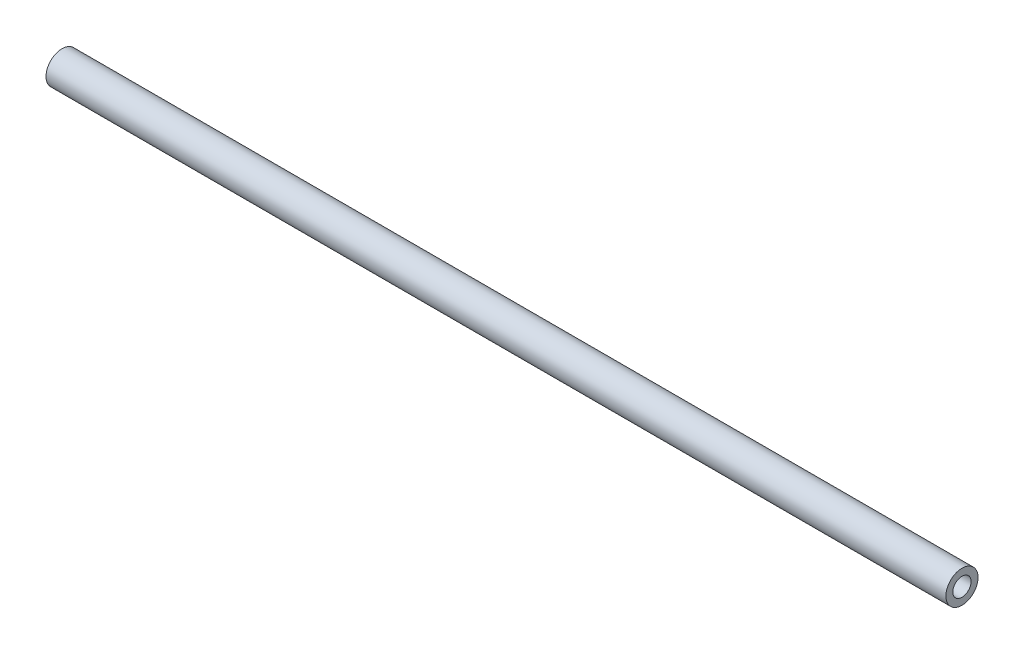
from build123d import *

# Parameters (mm, degrees)
SKETCH1_W                           = 133.35
SKETCH1_H                           = 2.38125
F_6_32_TAPPED_HOLE1_D               = 2.7051
F_6_32_TAPPED_HOLE1_DEPTH           = 12.7
F_6_32_TAPPED_HOLE1_TIP             = 0.81269403
F_6_32_TAPPED_HOLE1_ON_FACE_2_D     = 2.7051
F_6_32_TAPPED_HOLE1_ON_FACE_2_DEPTH = 12.7
F_6_32_TAPPED_HOLE1_ON_FACE_2_TIP   = 0.81269403


with BuildPart() as part:
    # Sketch1 → Revolve1 (revolve)
    with BuildSketch(Plane.XY, mode=Mode.PRIVATE) as revolve1_sk:
        with Locations((0, 1.190625)):
            Rectangle(SKETCH1_W, SKETCH1_H)
    revolve(revolve1_sk.sketch.rotate(Axis((0, 0, 0), (1, 0, 0)), 90), axis=Axis((0, 0, 0), (1, 0, 0)))

    # 6-32 Tapped Hole1
    with Locations(Plane(origin=(66.675, 0, 0), x_dir=(0, 0, 1), z_dir=(1, 0, 0))):
        with Locations((0, 0)):
            Hole(F_6_32_TAPPED_HOLE1_D / 2, depth=F_6_32_TAPPED_HOLE1_DEPTH)
            with Locations((0, 0, -(F_6_32_TAPPED_HOLE1_DEPTH + F_6_32_TAPPED_HOLE1_TIP / 2))):  # 118° drill point
                Cone(0, F_6_32_TAPPED_HOLE1_D / 2, F_6_32_TAPPED_HOLE1_TIP, mode=Mode.SUBTRACT)

    # 6-32 Tapped Hole1 on face 2
    with Locations(Plane(origin=(-66.675, 0, 0), x_dir=(0, 0, -1), z_dir=(-1, 0, 0))):
        with Locations((0, 0)):
            Hole(F_6_32_TAPPED_HOLE1_ON_FACE_2_D / 2, depth=F_6_32_TAPPED_HOLE1_ON_FACE_2_DEPTH)
            with Locations((0, 0, -(F_6_32_TAPPED_HOLE1_ON_FACE_2_DEPTH + F_6_32_TAPPED_HOLE1_ON_FACE_2_TIP / 2))):  # 118° drill point
                Cone(0, F_6_32_TAPPED_HOLE1_ON_FACE_2_D / 2, F_6_32_TAPPED_HOLE1_ON_FACE_2_TIP, mode=Mode.SUBTRACT)


solid = part.part
